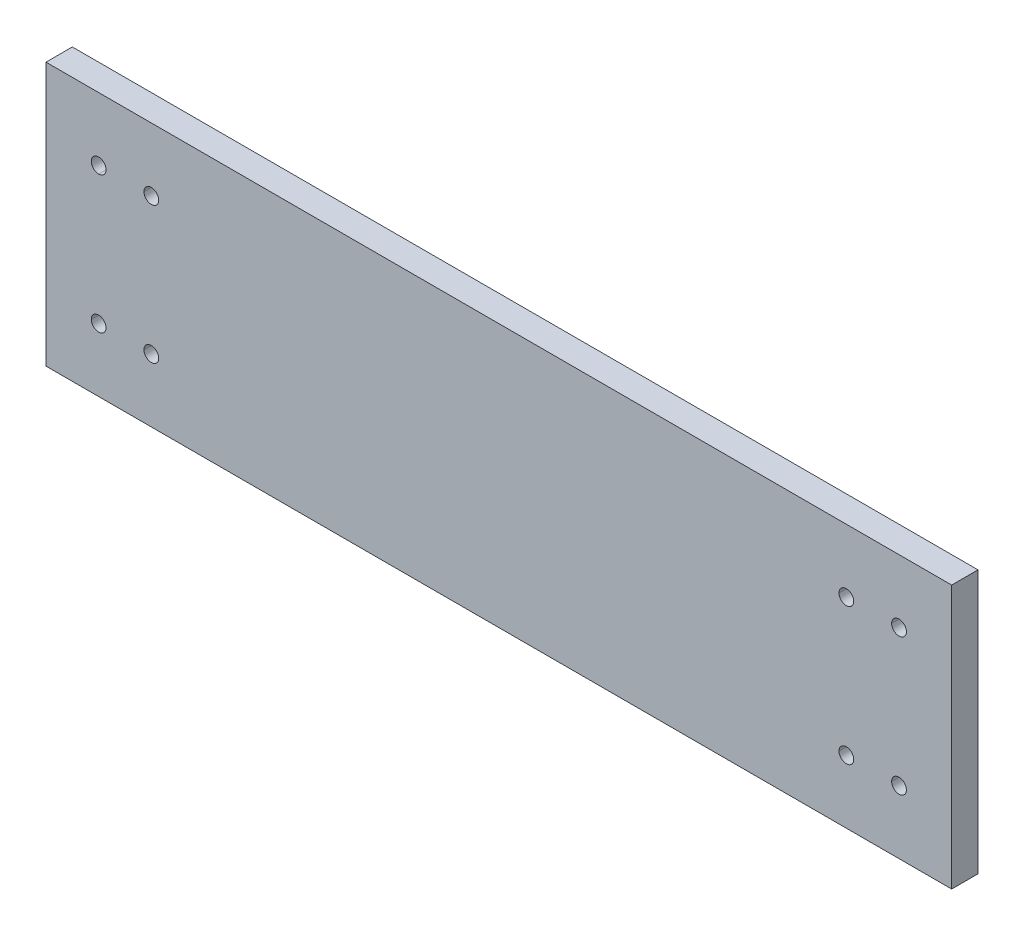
ISO-10303-21;
HEADER;
FILE_DESCRIPTION(('STEP AP214'),'2;1');
FILE_NAME('part.step','',(''),(''),'','','');
FILE_SCHEMA(('AUTOMOTIVE_DESIGN { 1 0 10303 214 1 1 1 1 }'));
ENDSEC;
DATA;
#1=APPLICATION_CONTEXT('core data for automotive mechanical design processes');
#2=APPLICATION_PROTOCOL_DEFINITION('international standard','automotive_design',2000,#1);
#3=PRODUCT_CONTEXT('',#1,'mechanical');
#4=PRODUCT('Part','Part','',(#3));
#5=PRODUCT_RELATED_PRODUCT_CATEGORY('part','',(#4));
#6=PRODUCT_DEFINITION_FORMATION('','',#4);
#7=PRODUCT_DEFINITION_CONTEXT('part definition',#1,'design');
#8=PRODUCT_DEFINITION('design','',#6,#7);
#9=PRODUCT_DEFINITION_SHAPE('','',#8);
#10=(LENGTH_UNIT() NAMED_UNIT(*) SI_UNIT(.MILLI.,.METRE.));
#11=(NAMED_UNIT(*) PLANE_ANGLE_UNIT() SI_UNIT($,.RADIAN.));
#12=(NAMED_UNIT(*) SI_UNIT($,.STERADIAN.) SOLID_ANGLE_UNIT());
#13=UNCERTAINTY_MEASURE_WITH_UNIT(LENGTH_MEASURE(1.E-05),#10,'distance_accuracy_value','');
#14=(GEOMETRIC_REPRESENTATION_CONTEXT(3) GLOBAL_UNCERTAINTY_ASSIGNED_CONTEXT((#13)) GLOBAL_UNIT_ASSIGNED_CONTEXT((#10,
#11,#12)) REPRESENTATION_CONTEXT('',''));
#15=CARTESIAN_POINT('',(0.,0.,0.));
#16=DIRECTION('',(0.,0.,1.));
#17=DIRECTION('',(1.,0.,0.));
#18=AXIS2_PLACEMENT_3D('',#15,#16,#17);
#19=CARTESIAN_POINT('',(-129.994774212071,0.0002718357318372,-456.450170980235));
#20=DIRECTION('',(0.,0.,-1.));
#21=DIRECTION('',(-1.,0.,0.));
#22=AXIS2_PLACEMENT_3D('',#19,#20,#21);
#23=PLANE('',#22);
#24=DIRECTION('',(0.999999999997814,-2.09112819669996E-06,0.));
#25=VECTOR('',#24,1.);
#26=CARTESIAN_POINT('',(730.004703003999,-250.001526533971,-456.450170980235));
#27=LINE('',#26,#25);
#28=CARTESIAN_POINT('',(-129.99529699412,-249.999728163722,-456.450170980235));
#29=VERTEX_POINT('',#28);
#30=CARTESIAN_POINT('',(730.004703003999,-250.001526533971,-456.450170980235));
#31=VERTEX_POINT('',#30);
#32=EDGE_CURVE('E292',#29,#31,#27,.T.);
#33=ORIENTED_EDGE('',*,*,#32,.F.);
#34=DIRECTION('',(-2.09112819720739E-06,-0.999999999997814,0.));
#35=VECTOR('',#34,1.);
#36=CARTESIAN_POINT('',(-129.99529699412,-249.999728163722,-456.450170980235));
#37=LINE('',#36,#35);
#38=CARTESIAN_POINT('',(-129.994774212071,0.000271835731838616,-456.450170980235));
#39=VERTEX_POINT('',#38);
#40=EDGE_CURVE('E289',#39,#29,#37,.T.);
#41=ORIENTED_EDGE('',*,*,#40,.F.);
#42=DIRECTION('',(-0.999999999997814,2.09112819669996E-06,0.));
#43=VECTOR('',#42,1.);
#44=CARTESIAN_POINT('',(-129.994774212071,0.0002718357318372,-456.450170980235));
#45=LINE('',#44,#43);
#46=CARTESIAN_POINT('',(730.005225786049,-0.00152653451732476,-456.450170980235));
#47=VERTEX_POINT('',#46);
#48=EDGE_CURVE('E284',#47,#39,#45,.T.);
#49=ORIENTED_EDGE('',*,*,#48,.F.);
#50=DIRECTION('',(2.09112819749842E-06,0.999999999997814,0.));
#51=VECTOR('',#50,1.);
#52=CARTESIAN_POINT('',(730.005225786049,-0.00152653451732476,-456.450170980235));
#53=LINE('',#52,#51);
#54=EDGE_CURVE('E278',#31,#47,#53,.T.);
#55=ORIENTED_EDGE('',*,*,#54,.F.);
#56=EDGE_LOOP('',(#33,#41,#49,#55));
#57=FACE_BOUND('',#56,.T.);
#58=CARTESIAN_POINT('',(-79.9948996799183,-59.9998327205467,-456.450170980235));
#59=DIRECTION('',(0.,0.,-1.));
#60=DIRECTION('',(-1.,0.,0.));
#61=AXIS2_PLACEMENT_3D('',#58,#59,#60);
#62=CIRCLE('',#61,7.);
#63=CARTESIAN_POINT('',(-79.9948850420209,-52.999832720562,-456.450170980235));
#64=VERTEX_POINT('',#63);
#65=CARTESIAN_POINT('',(-79.9949143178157,-66.9998327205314,-456.450170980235));
#66=VERTEX_POINT('',#65);
#67=EDGE_CURVE('E206',#64,#66,#62,.F.);
#68=ORIENTED_EDGE('',*,*,#67,.T.);
#69=CARTESIAN_POINT('',(-79.9948996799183,-59.9998327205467,-456.450170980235));
#70=DIRECTION('',(0.,0.,-1.));
#71=DIRECTION('',(-1.,0.,0.));
#72=AXIS2_PLACEMENT_3D('',#69,#70,#71);
#73=CIRCLE('',#72,7.);
#74=EDGE_CURVE('E204',#66,#64,#73,.F.);
#75=ORIENTED_EDGE('',*,*,#74,.T.);
#76=EDGE_LOOP('',(#68,#75));
#77=FACE_BOUND('',#76,.T.);
#78=CARTESIAN_POINT('',(-29.9948996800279,-59.9999372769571,-456.450170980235));
#79=DIRECTION('',(0.,0.,-1.));
#80=DIRECTION('',(0.,1.,0.));
#81=AXIS2_PLACEMENT_3D('',#78,#79,#80);
#82=CIRCLE('',#81,7.);
#83=CARTESIAN_POINT('',(-36.9948996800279,-59.9999372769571,-456.450170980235));
#84=VERTEX_POINT('',#83);
#85=CARTESIAN_POINT('',(-22.9948996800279,-59.9999372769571,-456.450170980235));
#86=VERTEX_POINT('',#85);
#87=EDGE_CURVE('E200',#84,#86,#82,.F.);
#88=ORIENTED_EDGE('',*,*,#87,.T.);
#89=CARTESIAN_POINT('',(-29.9948996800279,-59.9999372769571,-456.450170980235));
#90=DIRECTION('',(0.,0.,-1.));
#91=DIRECTION('',(0.,1.,0.));
#92=AXIS2_PLACEMENT_3D('',#89,#90,#91);
#93=CIRCLE('',#92,7.);
#94=EDGE_CURVE('E198',#86,#84,#93,.F.);
#95=ORIENTED_EDGE('',*,*,#94,.T.);
#96=EDGE_LOOP('',(#88,#95));
#97=FACE_BOUND('',#96,.T.);
#98=CARTESIAN_POINT('',(-29.9951715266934,-189.999937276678,-456.450170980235));
#99=DIRECTION('',(0.,0.,-1.));
#100=DIRECTION('',(0.,1.,0.));
#101=AXIS2_PLACEMENT_3D('',#98,#99,#100);
#102=CIRCLE('',#101,7.);
#103=CARTESIAN_POINT('',(-36.9951715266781,-189.999922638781,-456.450170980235));
#104=VERTEX_POINT('',#103);
#105=CARTESIAN_POINT('',(-22.9951715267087,-189.999951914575,-456.450170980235));
#106=VERTEX_POINT('',#105);
#107=EDGE_CURVE('E194',#104,#106,#102,.F.);
#108=ORIENTED_EDGE('',*,*,#107,.T.);
#109=CARTESIAN_POINT('',(-29.9951715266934,-189.999937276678,-456.450170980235));
#110=DIRECTION('',(0.,0.,-1.));
#111=DIRECTION('',(0.,1.,0.));
#112=AXIS2_PLACEMENT_3D('',#109,#110,#111);
#113=CIRCLE('',#112,7.);
#114=EDGE_CURVE('E192',#106,#104,#113,.F.);
#115=ORIENTED_EDGE('',*,*,#114,.T.);
#116=EDGE_LOOP('',(#108,#115));
#117=FACE_BOUND('',#116,.T.);
#118=CARTESIAN_POINT('',(-79.9951715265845,-189.999832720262,-456.450170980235));
#119=DIRECTION('',(0.,0.,-1.));
#120=DIRECTION('',(0.,1.,0.));
#121=AXIS2_PLACEMENT_3D('',#118,#119,#120);
#122=CIRCLE('',#121,7.);
#123=CARTESIAN_POINT('',(-86.9951715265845,-189.999832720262,-456.450170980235));
#124=VERTEX_POINT('',#123);
#125=CARTESIAN_POINT('',(-72.9951715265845,-189.999832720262,-456.450170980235));
#126=VERTEX_POINT('',#125);
#127=EDGE_CURVE('E188',#124,#126,#122,.F.);
#128=ORIENTED_EDGE('',*,*,#127,.T.);
#129=CARTESIAN_POINT('',(-79.9951715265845,-189.999832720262,-456.450170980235));
#130=DIRECTION('',(0.,0.,-1.));
#131=DIRECTION('',(0.,1.,0.));
#132=AXIS2_PLACEMENT_3D('',#129,#130,#131);
#133=CIRCLE('',#132,7.);
#134=EDGE_CURVE('E186',#126,#124,#133,.F.);
#135=ORIENTED_EDGE('',*,*,#134,.T.);
#136=EDGE_LOOP('',(#128,#135));
#137=FACE_BOUND('',#136,.T.);
#138=CARTESIAN_POINT('',(630.004828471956,-190.001317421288,-456.450170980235));
#139=DIRECTION('',(0.,0.,-1.));
#140=DIRECTION('',(0.,1.,0.));
#141=AXIS2_PLACEMENT_3D('',#138,#139,#140);
#142=CIRCLE('',#141,7.);
#143=CARTESIAN_POINT('',(623.004828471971,-190.001302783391,-456.450170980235));
#144=VERTEX_POINT('',#143);
#145=CARTESIAN_POINT('',(637.00482847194,-190.001332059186,-456.450170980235));
#146=VERTEX_POINT('',#145);
#147=EDGE_CURVE('E182',#144,#146,#142,.F.);
#148=ORIENTED_EDGE('',*,*,#147,.T.);
#149=CARTESIAN_POINT('',(630.004828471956,-190.001317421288,-456.450170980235));
#150=DIRECTION('',(0.,0.,-1.));
#151=DIRECTION('',(0.,1.,0.));
#152=AXIS2_PLACEMENT_3D('',#149,#150,#151);
#153=CIRCLE('',#152,7.);
#154=EDGE_CURVE('E180',#146,#144,#153,.F.);
#155=ORIENTED_EDGE('',*,*,#154,.T.);
#156=EDGE_LOOP('',(#148,#155));
#157=FACE_BOUND('',#156,.T.);
#158=CARTESIAN_POINT('',(680.004828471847,-190.001421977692,-456.450170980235));
#159=DIRECTION('',(0.,0.,-1.));
#160=DIRECTION('',(0.,1.,0.));
#161=AXIS2_PLACEMENT_3D('',#158,#159,#160);
#162=CIRCLE('',#161,7.);
#163=CARTESIAN_POINT('',(673.004828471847,-190.001421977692,-456.450170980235));
#164=VERTEX_POINT('',#163);
#165=CARTESIAN_POINT('',(687.004828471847,-190.001421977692,-456.450170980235));
#166=VERTEX_POINT('',#165);
#167=EDGE_CURVE('E176',#164,#166,#162,.F.);
#168=ORIENTED_EDGE('',*,*,#167,.T.);
#169=CARTESIAN_POINT('',(680.004828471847,-190.001421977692,-456.450170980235));
#170=DIRECTION('',(0.,0.,-1.));
#171=DIRECTION('',(0.,1.,0.));
#172=AXIS2_PLACEMENT_3D('',#169,#170,#171);
#173=CIRCLE('',#172,7.);
#174=EDGE_CURVE('E174',#166,#164,#173,.F.);
#175=ORIENTED_EDGE('',*,*,#174,.T.);
#176=EDGE_LOOP('',(#168,#175));
#177=FACE_BOUND('',#176,.T.);
#178=CARTESIAN_POINT('',(630.005100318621,-60.0013174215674,-456.450170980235));
#179=DIRECTION('',(0.,0.,-1.));
#180=DIRECTION('',(0.,1.,0.));
#181=AXIS2_PLACEMENT_3D('',#178,#179,#180);
#182=CIRCLE('',#181,7.);
#183=CARTESIAN_POINT('',(637.005100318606,-60.0013320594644,-456.450170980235));
#184=VERTEX_POINT('',#183);
#185=CARTESIAN_POINT('',(623.005100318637,-60.00130278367,-456.450170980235));
#186=VERTEX_POINT('',#185);
#187=EDGE_CURVE('E171',#184,#186,#182,.F.);
#188=ORIENTED_EDGE('',*,*,#187,.T.);
#189=CARTESIAN_POINT('',(630.005100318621,-60.0013174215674,-456.450170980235));
#190=DIRECTION('',(0.,0.,-1.));
#191=DIRECTION('',(0.,1.,0.));
#192=AXIS2_PLACEMENT_3D('',#189,#190,#191);
#193=CIRCLE('',#192,7.);
#194=EDGE_CURVE('E164',#186,#184,#193,.F.);
#195=ORIENTED_EDGE('',*,*,#194,.T.);
#196=EDGE_LOOP('',(#188,#195));
#197=FACE_BOUND('',#196,.T.);
#198=CARTESIAN_POINT('',(680.005100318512,-60.0014219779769,-456.450170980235));
#199=DIRECTION('',(0.,0.,-1.));
#200=DIRECTION('',(0.,1.,0.));
#201=AXIS2_PLACEMENT_3D('',#198,#199,#200);
#202=CIRCLE('',#201,7.);
#203=CARTESIAN_POINT('',(673.005100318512,-60.0014219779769,-456.450170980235));
#204=VERTEX_POINT('',#203);
#205=CARTESIAN_POINT('',(687.005100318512,-60.0014219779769,-456.450170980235));
#206=VERTEX_POINT('',#205);
#207=EDGE_CURVE('E151',#204,#206,#202,.F.);
#208=ORIENTED_EDGE('',*,*,#207,.T.);
#209=CARTESIAN_POINT('',(680.005100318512,-60.0014219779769,-456.450170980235));
#210=DIRECTION('',(0.,0.,-1.));
#211=DIRECTION('',(0.,1.,0.));
#212=AXIS2_PLACEMENT_3D('',#209,#210,#211);
#213=CIRCLE('',#212,7.);
#214=EDGE_CURVE('E20',#206,#204,#213,.F.);
#215=ORIENTED_EDGE('',*,*,#214,.T.);
#216=EDGE_LOOP('',(#208,#215));
#217=FACE_BOUND('',#216,.T.);
#218=ADVANCED_FACE('F17',(#57,#77,#97,#117,#137,#157,#177,#197,#217),#23,.T.);
#219=CARTESIAN_POINT('',(680.005100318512,-60.0014219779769,-443.950170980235));
#220=DIRECTION('',(0.,0.,-1.));
#221=DIRECTION('',(0.,1.,0.));
#222=AXIS2_PLACEMENT_3D('',#219,#220,#221);
#223=CYLINDRICAL_SURFACE('',#222,7.);
#224=ORIENTED_EDGE('',*,*,#214,.F.);
#225=DIRECTION('',(0.,0.,-1.));
#226=VECTOR('',#225,1.);
#227=CARTESIAN_POINT('',(687.005100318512,-60.0014219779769,-443.950170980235));
#228=LINE('',#227,#226);
#229=CARTESIAN_POINT('',(687.005100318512,-60.0014219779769,-431.450170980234));
#230=VERTEX_POINT('',#229);
#231=EDGE_CURVE('E165',#206,#230,#228,.F.);
#232=ORIENTED_EDGE('',*,*,#231,.T.);
#233=CARTESIAN_POINT('',(680.005100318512,-60.0014219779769,-431.450170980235));
#234=DIRECTION('',(0.,0.,-1.));
#235=DIRECTION('',(0.,1.,0.));
#236=AXIS2_PLACEMENT_3D('',#233,#234,#235);
#237=CIRCLE('',#236,7.);
#238=CARTESIAN_POINT('',(673.005100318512,-60.0014219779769,-431.450170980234));
#239=VERTEX_POINT('',#238);
#240=EDGE_CURVE('E160',#239,#230,#237,.T.);
#241=ORIENTED_EDGE('',*,*,#240,.F.);
#242=DIRECTION('',(0.,0.,-1.));
#243=VECTOR('',#242,1.);
#244=CARTESIAN_POINT('',(673.005100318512,-60.0014219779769,-443.950170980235));
#245=LINE('',#244,#243);
#246=EDGE_CURVE('E157',#239,#204,#245,.T.);
#247=ORIENTED_EDGE('',*,*,#246,.T.);
#248=EDGE_LOOP('',(#224,#232,#241,#247));
#249=FACE_BOUND('',#248,.T.);
#250=ADVANCED_FACE('F158',(#249),#223,.F.);
#251=CARTESIAN_POINT('',(680.005100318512,-60.0014219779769,-443.950170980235));
#252=DIRECTION('',(0.,0.,-1.));
#253=DIRECTION('',(0.,1.,0.));
#254=AXIS2_PLACEMENT_3D('',#251,#252,#253);
#255=CYLINDRICAL_SURFACE('',#254,7.);
#256=CARTESIAN_POINT('',(680.005100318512,-60.0014219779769,-431.450170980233));
#257=DIRECTION('',(0.,0.,-1.));
#258=DIRECTION('',(0.,1.,0.));
#259=AXIS2_PLACEMENT_3D('',#256,#257,#258);
#260=CIRCLE('',#259,7.);
#261=EDGE_CURVE('E211',#230,#239,#260,.T.);
#262=ORIENTED_EDGE('',*,*,#261,.F.);
#263=ORIENTED_EDGE('',*,*,#231,.F.);
#264=ORIENTED_EDGE('',*,*,#207,.F.);
#265=ORIENTED_EDGE('',*,*,#246,.F.);
#266=EDGE_LOOP('',(#262,#263,#264,#265));
#267=FACE_BOUND('',#266,.T.);
#268=ADVANCED_FACE('F167',(#267),#255,.F.);
#269=CARTESIAN_POINT('',(630.005100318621,-60.0013174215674,-443.950170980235));
#270=DIRECTION('',(0.,0.,-1.));
#271=DIRECTION('',(0.,1.,0.));
#272=AXIS2_PLACEMENT_3D('',#269,#270,#271);
#273=CYLINDRICAL_SURFACE('',#272,7.);
#274=ORIENTED_EDGE('',*,*,#194,.F.);
#275=DIRECTION('',(0.,0.,-1.));
#276=VECTOR('',#275,1.);
#277=CARTESIAN_POINT('',(623.005100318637,-60.00130278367,-443.950170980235));
#278=LINE('',#277,#276);
#279=CARTESIAN_POINT('',(623.005100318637,-60.00130278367,-431.450170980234));
#280=VERTEX_POINT('',#279);
#281=EDGE_CURVE('E173',#186,#280,#278,.F.);
#282=ORIENTED_EDGE('',*,*,#281,.T.);
#283=CARTESIAN_POINT('',(630.005100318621,-60.0013174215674,-431.450170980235));
#284=DIRECTION('',(0.,0.,-1.));
#285=DIRECTION('',(0.,1.,0.));
#286=AXIS2_PLACEMENT_3D('',#283,#284,#285);
#287=CIRCLE('',#286,7.);
#288=CARTESIAN_POINT('',(637.005100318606,-60.0013320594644,-431.450170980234));
#289=VERTEX_POINT('',#288);
#290=EDGE_CURVE('E214',#289,#280,#287,.T.);
#291=ORIENTED_EDGE('',*,*,#290,.F.);
#292=DIRECTION('',(0.,0.,-1.));
#293=VECTOR('',#292,1.);
#294=CARTESIAN_POINT('',(637.005100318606,-60.0013320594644,-443.950170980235));
#295=LINE('',#294,#293);
#296=EDGE_CURVE('E177',#289,#184,#295,.T.);
#297=ORIENTED_EDGE('',*,*,#296,.T.);
#298=EDGE_LOOP('',(#274,#282,#291,#297));
#299=FACE_BOUND('',#298,.T.);
#300=ADVANCED_FACE('F458',(#299),#273,.F.);
#301=CARTESIAN_POINT('',(630.005100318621,-60.0013174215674,-443.950170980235));
#302=DIRECTION('',(0.,0.,-1.));
#303=DIRECTION('',(0.,1.,0.));
#304=AXIS2_PLACEMENT_3D('',#301,#302,#303);
#305=CYLINDRICAL_SURFACE('',#304,7.);
#306=CARTESIAN_POINT('',(630.005100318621,-60.0013174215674,-431.450170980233));
#307=DIRECTION('',(0.,0.,-1.));
#308=DIRECTION('',(0.,1.,0.));
#309=AXIS2_PLACEMENT_3D('',#306,#307,#308);
#310=CIRCLE('',#309,7.);
#311=EDGE_CURVE('E217',#280,#289,#310,.T.);
#312=ORIENTED_EDGE('',*,*,#311,.F.);
#313=ORIENTED_EDGE('',*,*,#281,.F.);
#314=ORIENTED_EDGE('',*,*,#187,.F.);
#315=ORIENTED_EDGE('',*,*,#296,.F.);
#316=EDGE_LOOP('',(#312,#313,#314,#315));
#317=FACE_BOUND('',#316,.T.);
#318=ADVANCED_FACE('F450',(#317),#305,.F.);
#319=CARTESIAN_POINT('',(680.004828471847,-190.001421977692,-443.950170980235));
#320=DIRECTION('',(0.,0.,-1.));
#321=DIRECTION('',(0.,1.,0.));
#322=AXIS2_PLACEMENT_3D('',#319,#320,#321);
#323=CYLINDRICAL_SURFACE('',#322,7.);
#324=ORIENTED_EDGE('',*,*,#174,.F.);
#325=DIRECTION('',(0.,0.,-1.));
#326=VECTOR('',#325,1.);
#327=CARTESIAN_POINT('',(687.004828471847,-190.001421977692,-443.950170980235));
#328=LINE('',#327,#326);
#329=CARTESIAN_POINT('',(687.004828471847,-190.001421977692,-431.450170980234));
#330=VERTEX_POINT('',#329);
#331=EDGE_CURVE('E179',#166,#330,#328,.F.);
#332=ORIENTED_EDGE('',*,*,#331,.T.);
#333=CARTESIAN_POINT('',(680.004828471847,-190.001421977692,-431.450170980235));
#334=DIRECTION('',(0.,0.,-1.));
#335=DIRECTION('',(0.,1.,0.));
#336=AXIS2_PLACEMENT_3D('',#333,#334,#335);
#337=CIRCLE('',#336,7.);
#338=CARTESIAN_POINT('',(673.004828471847,-190.001421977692,-431.450170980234));
#339=VERTEX_POINT('',#338);
#340=EDGE_CURVE('E220',#339,#330,#337,.T.);
#341=ORIENTED_EDGE('',*,*,#340,.F.);
#342=DIRECTION('',(0.,0.,-1.));
#343=VECTOR('',#342,1.);
#344=CARTESIAN_POINT('',(673.004828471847,-190.001421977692,-443.950170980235));
#345=LINE('',#344,#343);
#346=EDGE_CURVE('E183',#339,#164,#345,.T.);
#347=ORIENTED_EDGE('',*,*,#346,.T.);
#348=EDGE_LOOP('',(#324,#332,#341,#347));
#349=FACE_BOUND('',#348,.T.);
#350=ADVANCED_FACE('F442',(#349),#323,.F.);
#351=CARTESIAN_POINT('',(680.004828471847,-190.001421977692,-443.950170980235));
#352=DIRECTION('',(0.,0.,-1.));
#353=DIRECTION('',(0.,1.,0.));
#354=AXIS2_PLACEMENT_3D('',#351,#352,#353);
#355=CYLINDRICAL_SURFACE('',#354,7.);
#356=CARTESIAN_POINT('',(680.004828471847,-190.001421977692,-431.450170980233));
#357=DIRECTION('',(0.,0.,-1.));
#358=DIRECTION('',(0.,1.,0.));
#359=AXIS2_PLACEMENT_3D('',#356,#357,#358);
#360=CIRCLE('',#359,7.);
#361=EDGE_CURVE('E223',#330,#339,#360,.T.);
#362=ORIENTED_EDGE('',*,*,#361,.F.);
#363=ORIENTED_EDGE('',*,*,#331,.F.);
#364=ORIENTED_EDGE('',*,*,#167,.F.);
#365=ORIENTED_EDGE('',*,*,#346,.F.);
#366=EDGE_LOOP('',(#362,#363,#364,#365));
#367=FACE_BOUND('',#366,.T.);
#368=ADVANCED_FACE('F434',(#367),#355,.F.);
#369=CARTESIAN_POINT('',(630.004828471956,-190.001317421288,-443.950170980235));
#370=DIRECTION('',(0.,0.,-1.));
#371=DIRECTION('',(0.,1.,0.));
#372=AXIS2_PLACEMENT_3D('',#369,#370,#371);
#373=CYLINDRICAL_SURFACE('',#372,7.);
#374=ORIENTED_EDGE('',*,*,#154,.F.);
#375=DIRECTION('',(0.,0.,-1.));
#376=VECTOR('',#375,1.);
#377=CARTESIAN_POINT('',(637.00482847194,-190.001332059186,-443.950170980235));
#378=LINE('',#377,#376);
#379=CARTESIAN_POINT('',(637.00482847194,-190.001332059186,-431.450170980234));
#380=VERTEX_POINT('',#379);
#381=EDGE_CURVE('E185',#146,#380,#378,.F.);
#382=ORIENTED_EDGE('',*,*,#381,.T.);
#383=CARTESIAN_POINT('',(630.004828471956,-190.001317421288,-431.450170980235));
#384=DIRECTION('',(0.,0.,-1.));
#385=DIRECTION('',(0.,1.,0.));
#386=AXIS2_PLACEMENT_3D('',#383,#384,#385);
#387=CIRCLE('',#386,7.);
#388=CARTESIAN_POINT('',(623.004828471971,-190.001302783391,-431.450170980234));
#389=VERTEX_POINT('',#388);
#390=EDGE_CURVE('E226',#389,#380,#387,.T.);
#391=ORIENTED_EDGE('',*,*,#390,.F.);
#392=DIRECTION('',(0.,0.,-1.));
#393=VECTOR('',#392,1.);
#394=CARTESIAN_POINT('',(623.004828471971,-190.001302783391,-443.950170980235));
#395=LINE('',#394,#393);
#396=EDGE_CURVE('E189',#389,#144,#395,.T.);
#397=ORIENTED_EDGE('',*,*,#396,.T.);
#398=EDGE_LOOP('',(#374,#382,#391,#397));
#399=FACE_BOUND('',#398,.T.);
#400=ADVANCED_FACE('F426',(#399),#373,.F.);
#401=CARTESIAN_POINT('',(630.004828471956,-190.001317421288,-443.950170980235));
#402=DIRECTION('',(0.,0.,-1.));
#403=DIRECTION('',(0.,1.,0.));
#404=AXIS2_PLACEMENT_3D('',#401,#402,#403);
#405=CYLINDRICAL_SURFACE('',#404,7.);
#406=CARTESIAN_POINT('',(630.004828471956,-190.001317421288,-431.450170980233));
#407=DIRECTION('',(0.,0.,-1.));
#408=DIRECTION('',(0.,1.,0.));
#409=AXIS2_PLACEMENT_3D('',#406,#407,#408);
#410=CIRCLE('',#409,7.);
#411=EDGE_CURVE('E229',#380,#389,#410,.T.);
#412=ORIENTED_EDGE('',*,*,#411,.F.);
#413=ORIENTED_EDGE('',*,*,#381,.F.);
#414=ORIENTED_EDGE('',*,*,#147,.F.);
#415=ORIENTED_EDGE('',*,*,#396,.F.);
#416=EDGE_LOOP('',(#412,#413,#414,#415));
#417=FACE_BOUND('',#416,.T.);
#418=ADVANCED_FACE('F418',(#417),#405,.F.);
#419=CARTESIAN_POINT('',(-79.9951715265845,-189.999832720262,-443.950170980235));
#420=DIRECTION('',(0.,0.,-1.));
#421=DIRECTION('',(0.,1.,0.));
#422=AXIS2_PLACEMENT_3D('',#419,#420,#421);
#423=CYLINDRICAL_SURFACE('',#422,7.);
#424=ORIENTED_EDGE('',*,*,#134,.F.);
#425=DIRECTION('',(0.,0.,-1.));
#426=VECTOR('',#425,1.);
#427=CARTESIAN_POINT('',(-72.9951715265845,-189.999832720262,-443.950170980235));
#428=LINE('',#427,#426);
#429=CARTESIAN_POINT('',(-72.9951715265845,-189.999832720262,-431.450170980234));
#430=VERTEX_POINT('',#429);
#431=EDGE_CURVE('E191',#126,#430,#428,.F.);
#432=ORIENTED_EDGE('',*,*,#431,.T.);
#433=CARTESIAN_POINT('',(-79.9951715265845,-189.999832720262,-431.450170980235));
#434=DIRECTION('',(0.,0.,-1.));
#435=DIRECTION('',(0.,1.,0.));
#436=AXIS2_PLACEMENT_3D('',#433,#434,#435);
#437=CIRCLE('',#436,7.);
#438=CARTESIAN_POINT('',(-86.9951715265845,-189.999832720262,-431.450170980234));
#439=VERTEX_POINT('',#438);
#440=EDGE_CURVE('E232',#439,#430,#437,.T.);
#441=ORIENTED_EDGE('',*,*,#440,.F.);
#442=DIRECTION('',(0.,0.,-1.));
#443=VECTOR('',#442,1.);
#444=CARTESIAN_POINT('',(-86.9951715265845,-189.999832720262,-443.950170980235));
#445=LINE('',#444,#443);
#446=EDGE_CURVE('E195',#439,#124,#445,.T.);
#447=ORIENTED_EDGE('',*,*,#446,.T.);
#448=EDGE_LOOP('',(#424,#432,#441,#447));
#449=FACE_BOUND('',#448,.T.);
#450=ADVANCED_FACE('F410',(#449),#423,.F.);
#451=CARTESIAN_POINT('',(-79.9951715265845,-189.999832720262,-443.950170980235));
#452=DIRECTION('',(0.,0.,-1.));
#453=DIRECTION('',(0.,1.,0.));
#454=AXIS2_PLACEMENT_3D('',#451,#452,#453);
#455=CYLINDRICAL_SURFACE('',#454,7.);
#456=CARTESIAN_POINT('',(-79.9951715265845,-189.999832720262,-431.450170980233));
#457=DIRECTION('',(0.,0.,-1.));
#458=DIRECTION('',(0.,1.,0.));
#459=AXIS2_PLACEMENT_3D('',#456,#457,#458);
#460=CIRCLE('',#459,7.);
#461=EDGE_CURVE('E235',#430,#439,#460,.T.);
#462=ORIENTED_EDGE('',*,*,#461,.F.);
#463=ORIENTED_EDGE('',*,*,#431,.F.);
#464=ORIENTED_EDGE('',*,*,#127,.F.);
#465=ORIENTED_EDGE('',*,*,#446,.F.);
#466=EDGE_LOOP('',(#462,#463,#464,#465));
#467=FACE_BOUND('',#466,.T.);
#468=ADVANCED_FACE('F402',(#467),#455,.F.);
#469=CARTESIAN_POINT('',(-29.9951715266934,-189.999937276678,-443.950170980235));
#470=DIRECTION('',(0.,0.,-1.));
#471=DIRECTION('',(0.,1.,0.));
#472=AXIS2_PLACEMENT_3D('',#469,#470,#471);
#473=CYLINDRICAL_SURFACE('',#472,7.);
#474=ORIENTED_EDGE('',*,*,#114,.F.);
#475=DIRECTION('',(0.,0.,-1.));
#476=VECTOR('',#475,1.);
#477=CARTESIAN_POINT('',(-22.9951715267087,-189.999951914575,-443.950170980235));
#478=LINE('',#477,#476);
#479=CARTESIAN_POINT('',(-22.9951715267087,-189.999951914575,-431.450170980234));
#480=VERTEX_POINT('',#479);
#481=EDGE_CURVE('E197',#106,#480,#478,.F.);
#482=ORIENTED_EDGE('',*,*,#481,.T.);
#483=CARTESIAN_POINT('',(-29.9951715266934,-189.999937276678,-431.450170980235));
#484=DIRECTION('',(0.,0.,-1.));
#485=DIRECTION('',(0.,1.,0.));
#486=AXIS2_PLACEMENT_3D('',#483,#484,#485);
#487=CIRCLE('',#486,7.);
#488=CARTESIAN_POINT('',(-36.9951715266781,-189.999922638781,-431.450170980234));
#489=VERTEX_POINT('',#488);
#490=EDGE_CURVE('E238',#489,#480,#487,.T.);
#491=ORIENTED_EDGE('',*,*,#490,.F.);
#492=DIRECTION('',(0.,0.,-1.));
#493=VECTOR('',#492,1.);
#494=CARTESIAN_POINT('',(-36.9951715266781,-189.999922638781,-443.950170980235));
#495=LINE('',#494,#493);
#496=EDGE_CURVE('E201',#489,#104,#495,.T.);
#497=ORIENTED_EDGE('',*,*,#496,.T.);
#498=EDGE_LOOP('',(#474,#482,#491,#497));
#499=FACE_BOUND('',#498,.T.);
#500=ADVANCED_FACE('F394',(#499),#473,.F.);
#501=CARTESIAN_POINT('',(-29.9951715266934,-189.999937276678,-443.950170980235));
#502=DIRECTION('',(0.,0.,-1.));
#503=DIRECTION('',(0.,1.,0.));
#504=AXIS2_PLACEMENT_3D('',#501,#502,#503);
#505=CYLINDRICAL_SURFACE('',#504,7.);
#506=CARTESIAN_POINT('',(-29.9951715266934,-189.999937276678,-431.450170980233));
#507=DIRECTION('',(0.,0.,-1.));
#508=DIRECTION('',(0.,1.,0.));
#509=AXIS2_PLACEMENT_3D('',#506,#507,#508);
#510=CIRCLE('',#509,7.);
#511=EDGE_CURVE('E241',#480,#489,#510,.T.);
#512=ORIENTED_EDGE('',*,*,#511,.F.);
#513=ORIENTED_EDGE('',*,*,#481,.F.);
#514=ORIENTED_EDGE('',*,*,#107,.F.);
#515=ORIENTED_EDGE('',*,*,#496,.F.);
#516=EDGE_LOOP('',(#512,#513,#514,#515));
#517=FACE_BOUND('',#516,.T.);
#518=ADVANCED_FACE('F386',(#517),#505,.F.);
#519=CARTESIAN_POINT('',(-29.9948996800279,-59.9999372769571,-443.950170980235));
#520=DIRECTION('',(0.,0.,-1.));
#521=DIRECTION('',(0.,1.,0.));
#522=AXIS2_PLACEMENT_3D('',#519,#520,#521);
#523=CYLINDRICAL_SURFACE('',#522,7.);
#524=ORIENTED_EDGE('',*,*,#94,.F.);
#525=DIRECTION('',(0.,0.,-1.));
#526=VECTOR('',#525,1.);
#527=CARTESIAN_POINT('',(-22.9948996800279,-59.9999372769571,-443.950170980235));
#528=LINE('',#527,#526);
#529=CARTESIAN_POINT('',(-22.9948996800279,-59.9999372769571,-431.450170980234));
#530=VERTEX_POINT('',#529);
#531=EDGE_CURVE('E203',#86,#530,#528,.F.);
#532=ORIENTED_EDGE('',*,*,#531,.T.);
#533=CARTESIAN_POINT('',(-29.9948996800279,-59.9999372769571,-431.450170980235));
#534=DIRECTION('',(0.,0.,-1.));
#535=DIRECTION('',(0.,1.,0.));
#536=AXIS2_PLACEMENT_3D('',#533,#534,#535);
#537=CIRCLE('',#536,7.);
#538=CARTESIAN_POINT('',(-36.9948996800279,-59.9999372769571,-431.450170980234));
#539=VERTEX_POINT('',#538);
#540=EDGE_CURVE('E244',#539,#530,#537,.T.);
#541=ORIENTED_EDGE('',*,*,#540,.F.);
#542=DIRECTION('',(0.,0.,-1.));
#543=VECTOR('',#542,1.);
#544=CARTESIAN_POINT('',(-36.9948996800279,-59.9999372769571,-443.950170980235));
#545=LINE('',#544,#543);
#546=EDGE_CURVE('E207',#539,#84,#545,.T.);
#547=ORIENTED_EDGE('',*,*,#546,.T.);
#548=EDGE_LOOP('',(#524,#532,#541,#547));
#549=FACE_BOUND('',#548,.T.);
#550=ADVANCED_FACE('F378',(#549),#523,.F.);
#551=CARTESIAN_POINT('',(-29.9948996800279,-59.9999372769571,-443.950170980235));
#552=DIRECTION('',(0.,0.,-1.));
#553=DIRECTION('',(0.,1.,0.));
#554=AXIS2_PLACEMENT_3D('',#551,#552,#553);
#555=CYLINDRICAL_SURFACE('',#554,7.);
#556=CARTESIAN_POINT('',(-29.9948996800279,-59.9999372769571,-431.450170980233));
#557=DIRECTION('',(0.,0.,-1.));
#558=DIRECTION('',(0.,1.,0.));
#559=AXIS2_PLACEMENT_3D('',#556,#557,#558);
#560=CIRCLE('',#559,7.);
#561=EDGE_CURVE('E247',#530,#539,#560,.T.);
#562=ORIENTED_EDGE('',*,*,#561,.F.);
#563=ORIENTED_EDGE('',*,*,#531,.F.);
#564=ORIENTED_EDGE('',*,*,#87,.F.);
#565=ORIENTED_EDGE('',*,*,#546,.F.);
#566=EDGE_LOOP('',(#562,#563,#564,#565));
#567=FACE_BOUND('',#566,.T.);
#568=ADVANCED_FACE('F370',(#567),#555,.F.);
#569=CARTESIAN_POINT('',(-79.9948996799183,-59.9998327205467,-443.950170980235));
#570=DIRECTION('',(0.,0.,-1.));
#571=DIRECTION('',(-1.,0.,0.));
#572=AXIS2_PLACEMENT_3D('',#569,#570,#571);
#573=CYLINDRICAL_SURFACE('',#572,7.);
#574=ORIENTED_EDGE('',*,*,#74,.F.);
#575=DIRECTION('',(0.,0.,-1.));
#576=VECTOR('',#575,1.);
#577=CARTESIAN_POINT('',(-79.9949143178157,-66.9998327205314,-443.950170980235));
#578=LINE('',#577,#576);
#579=CARTESIAN_POINT('',(-79.9949143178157,-66.9998327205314,-431.450170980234));
#580=VERTEX_POINT('',#579);
#581=EDGE_CURVE('E209',#66,#580,#578,.F.);
#582=ORIENTED_EDGE('',*,*,#581,.T.);
#583=CARTESIAN_POINT('',(-79.9948996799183,-59.9998327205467,-431.450170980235));
#584=DIRECTION('',(0.,0.,-1.));
#585=DIRECTION('',(-1.,0.,0.));
#586=AXIS2_PLACEMENT_3D('',#583,#584,#585);
#587=CIRCLE('',#586,7.);
#588=CARTESIAN_POINT('',(-79.9948850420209,-52.999832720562,-431.450170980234));
#589=VERTEX_POINT('',#588);
#590=EDGE_CURVE('E250',#589,#580,#587,.T.);
#591=ORIENTED_EDGE('',*,*,#590,.F.);
#592=DIRECTION('',(0.,0.,-1.));
#593=VECTOR('',#592,1.);
#594=CARTESIAN_POINT('',(-79.9948850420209,-52.999832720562,-443.950170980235));
#595=LINE('',#594,#593);
#596=EDGE_CURVE('E275',#589,#64,#595,.T.);
#597=ORIENTED_EDGE('',*,*,#596,.T.);
#598=EDGE_LOOP('',(#574,#582,#591,#597));
#599=FACE_BOUND('',#598,.T.);
#600=ADVANCED_FACE('F329',(#599),#573,.F.);
#601=CARTESIAN_POINT('',(-79.9948996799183,-59.9998327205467,-443.950170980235));
#602=DIRECTION('',(0.,0.,-1.));
#603=DIRECTION('',(-1.,0.,0.));
#604=AXIS2_PLACEMENT_3D('',#601,#602,#603);
#605=CYLINDRICAL_SURFACE('',#604,7.);
#606=CARTESIAN_POINT('',(-79.9948996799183,-59.9998327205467,-431.450170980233));
#607=DIRECTION('',(0.,0.,-1.));
#608=DIRECTION('',(-1.,0.,0.));
#609=AXIS2_PLACEMENT_3D('',#606,#607,#608);
#610=CIRCLE('',#609,7.);
#611=EDGE_CURVE('E253',#580,#589,#610,.T.);
#612=ORIENTED_EDGE('',*,*,#611,.F.);
#613=ORIENTED_EDGE('',*,*,#581,.F.);
#614=ORIENTED_EDGE('',*,*,#67,.F.);
#615=ORIENTED_EDGE('',*,*,#596,.F.);
#616=EDGE_LOOP('',(#612,#613,#614,#615));
#617=FACE_BOUND('',#616,.T.);
#618=ADVANCED_FACE('F321',(#617),#605,.F.);
#619=CARTESIAN_POINT('',(730.005225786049,-0.00152653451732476,-431.450170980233));
#620=DIRECTION('',(0.999999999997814,-2.09112819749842E-06,0.));
#621=DIRECTION('',(2.09112819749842E-06,0.999999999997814,0.));
#622=AXIS2_PLACEMENT_3D('',#619,#620,#621);
#623=PLANE('',#622);
#624=ORIENTED_EDGE('',*,*,#54,.T.);
#625=DIRECTION('',(0.,0.,1.));
#626=VECTOR('',#625,1.);
#627=CARTESIAN_POINT('',(730.005225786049,-0.00152653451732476,-431.450170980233));
#628=LINE('',#627,#626);
#629=CARTESIAN_POINT('',(730.005225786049,-0.00152653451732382,-431.450170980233));
#630=VERTEX_POINT('',#629);
#631=EDGE_CURVE('E281',#630,#47,#628,.F.);
#632=ORIENTED_EDGE('',*,*,#631,.F.);
#633=DIRECTION('',(2.09112819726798E-06,0.999999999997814,0.));
#634=VECTOR('',#633,1.);
#635=CARTESIAN_POINT('',(730.004703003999,-250.001526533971,-431.450170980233));
#636=LINE('',#635,#634);
#637=CARTESIAN_POINT('',(730.004703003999,-250.001526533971,-431.450170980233));
#638=VERTEX_POINT('',#637);
#639=EDGE_CURVE('E255',#638,#630,#636,.T.);
#640=ORIENTED_EDGE('',*,*,#639,.F.);
#641=DIRECTION('',(0.,0.,1.));
#642=VECTOR('',#641,1.);
#643=CARTESIAN_POINT('',(730.004703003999,-250.001526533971,-431.450170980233));
#644=LINE('',#643,#642);
#645=EDGE_CURVE('E212',#31,#638,#644,.T.);
#646=ORIENTED_EDGE('',*,*,#645,.F.);
#647=EDGE_LOOP('',(#624,#632,#640,#646));
#648=FACE_BOUND('',#647,.T.);
#649=ADVANCED_FACE('F319',(#648),#623,.T.);
#650=CARTESIAN_POINT('',(-129.994774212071,0.0002718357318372,-431.450170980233));
#651=DIRECTION('',(2.09112819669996E-06,0.999999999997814,0.));
#652=DIRECTION('',(-0.999999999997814,2.09112819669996E-06,0.));
#653=AXIS2_PLACEMENT_3D('',#650,#651,#652);
#654=PLANE('',#653);
#655=ORIENTED_EDGE('',*,*,#48,.T.);
#656=DIRECTION('',(0.,0.,1.));
#657=VECTOR('',#656,1.);
#658=CARTESIAN_POINT('',(-129.994774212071,0.000271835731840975,-431.450170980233));
#659=LINE('',#658,#657);
#660=CARTESIAN_POINT('',(-129.994774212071,0.000271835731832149,-431.450170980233));
#661=VERTEX_POINT('',#660);
#662=EDGE_CURVE('E286',#661,#39,#659,.F.);
#663=ORIENTED_EDGE('',*,*,#662,.F.);
#664=DIRECTION('',(-0.999999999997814,2.09112819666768E-06,0.));
#665=VECTOR('',#664,1.);
#666=CARTESIAN_POINT('',(730.005225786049,-0.00152653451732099,-431.450170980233));
#667=LINE('',#666,#665);
#668=EDGE_CURVE('E299',#630,#661,#667,.T.);
#669=ORIENTED_EDGE('',*,*,#668,.F.);
#670=ORIENTED_EDGE('',*,*,#631,.T.);
#671=EDGE_LOOP('',(#655,#663,#669,#670));
#672=FACE_BOUND('',#671,.T.);
#673=ADVANCED_FACE('F311',(#672),#654,.T.);
#674=CARTESIAN_POINT('',(-129.99529699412,-249.999728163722,-431.450170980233));
#675=DIRECTION('',(-0.999999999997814,2.09112819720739E-06,0.));
#676=DIRECTION('',(-2.09112819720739E-06,-0.999999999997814,0.));
#677=AXIS2_PLACEMENT_3D('',#674,#675,#676);
#678=PLANE('',#677);
#679=ORIENTED_EDGE('',*,*,#40,.T.);
#680=DIRECTION('',(0.,0.,1.));
#681=VECTOR('',#680,1.);
#682=CARTESIAN_POINT('',(-129.99529699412,-249.999728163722,-431.450170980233));
#683=LINE('',#682,#681);
#684=CARTESIAN_POINT('',(-129.99529699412,-249.999728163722,-431.450170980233));
#685=VERTEX_POINT('',#684);
#686=EDGE_CURVE('E35',#685,#29,#683,.F.);
#687=ORIENTED_EDGE('',*,*,#686,.F.);
#688=DIRECTION('',(-2.09112819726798E-06,-0.999999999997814,0.));
#689=VECTOR('',#688,1.);
#690=CARTESIAN_POINT('',(-129.994774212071,0.000271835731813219,-431.450170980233));
#691=LINE('',#690,#689);
#692=EDGE_CURVE('E26',#661,#685,#691,.T.);
#693=ORIENTED_EDGE('',*,*,#692,.F.);
#694=ORIENTED_EDGE('',*,*,#662,.T.);
#695=EDGE_LOOP('',(#679,#687,#693,#694));
#696=FACE_BOUND('',#695,.T.);
#697=ADVANCED_FACE('F307',(#696),#678,.T.);
#698=CARTESIAN_POINT('',(730.004703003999,-250.001526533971,-431.450170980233));
#699=DIRECTION('',(-2.09112819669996E-06,-0.999999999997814,0.));
#700=DIRECTION('',(0.999999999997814,-2.09112819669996E-06,0.));
#701=AXIS2_PLACEMENT_3D('',#698,#699,#700);
#702=PLANE('',#701);
#703=ORIENTED_EDGE('',*,*,#32,.T.);
#704=ORIENTED_EDGE('',*,*,#645,.T.);
#705=DIRECTION('',(0.999999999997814,-2.09112819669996E-06,0.));
#706=VECTOR('',#705,1.);
#707=CARTESIAN_POINT('',(-129.99529699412,-249.999728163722,-431.450170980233));
#708=LINE('',#707,#706);
#709=EDGE_CURVE('E11',#685,#638,#708,.T.);
#710=ORIENTED_EDGE('',*,*,#709,.F.);
#711=ORIENTED_EDGE('',*,*,#686,.T.);
#712=EDGE_LOOP('',(#703,#704,#710,#711));
#713=FACE_BOUND('',#712,.T.);
#714=ADVANCED_FACE('F317',(#713),#702,.T.);
#715=CARTESIAN_POINT('',(730.004703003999,-250.001526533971,-431.450170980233));
#716=DIRECTION('',(0.,0.,1.));
#717=DIRECTION('',(0.,-1.,0.));
#718=AXIS2_PLACEMENT_3D('',#715,#716,#717);
#719=PLANE('',#718);
#720=ORIENTED_EDGE('',*,*,#692,.T.);
#721=ORIENTED_EDGE('',*,*,#709,.T.);
#722=ORIENTED_EDGE('',*,*,#639,.T.);
#723=ORIENTED_EDGE('',*,*,#668,.T.);
#724=EDGE_LOOP('',(#720,#721,#722,#723));
#725=FACE_BOUND('',#724,.T.);
#726=ORIENTED_EDGE('',*,*,#590,.T.);
#727=ORIENTED_EDGE('',*,*,#611,.T.);
#728=EDGE_LOOP('',(#726,#727));
#729=FACE_BOUND('',#728,.T.);
#730=ORIENTED_EDGE('',*,*,#540,.T.);
#731=ORIENTED_EDGE('',*,*,#561,.T.);
#732=EDGE_LOOP('',(#730,#731));
#733=FACE_BOUND('',#732,.T.);
#734=ORIENTED_EDGE('',*,*,#490,.T.);
#735=ORIENTED_EDGE('',*,*,#511,.T.);
#736=EDGE_LOOP('',(#734,#735));
#737=FACE_BOUND('',#736,.T.);
#738=ORIENTED_EDGE('',*,*,#440,.T.);
#739=ORIENTED_EDGE('',*,*,#461,.T.);
#740=EDGE_LOOP('',(#738,#739));
#741=FACE_BOUND('',#740,.T.);
#742=ORIENTED_EDGE('',*,*,#390,.T.);
#743=ORIENTED_EDGE('',*,*,#411,.T.);
#744=EDGE_LOOP('',(#742,#743));
#745=FACE_BOUND('',#744,.T.);
#746=ORIENTED_EDGE('',*,*,#340,.T.);
#747=ORIENTED_EDGE('',*,*,#361,.T.);
#748=EDGE_LOOP('',(#746,#747));
#749=FACE_BOUND('',#748,.T.);
#750=ORIENTED_EDGE('',*,*,#290,.T.);
#751=ORIENTED_EDGE('',*,*,#311,.T.);
#752=EDGE_LOOP('',(#750,#751));
#753=FACE_BOUND('',#752,.T.);
#754=ORIENTED_EDGE('',*,*,#240,.T.);
#755=ORIENTED_EDGE('',*,*,#261,.T.);
#756=EDGE_LOOP('',(#754,#755));
#757=FACE_BOUND('',#756,.T.);
#758=ADVANCED_FACE('F304',(#725,#729,#733,#737,#741,#745,#749,#753,#757),#719,.T.);
#759=CLOSED_SHELL('',(#218,#250,#268,#300,#318,#350,#368,#400,#418,#450,#468,#500,#518,#550,
#568,#600,#618,#649,#673,#697,#714,#758));
#760=MANIFOLD_SOLID_BREP('B1',#759);
#761=ADVANCED_BREP_SHAPE_REPRESENTATION('',(#18,#760),#14);
#762=SHAPE_DEFINITION_REPRESENTATION(#9,#761);
ENDSEC;
END-ISO-10303-21;
